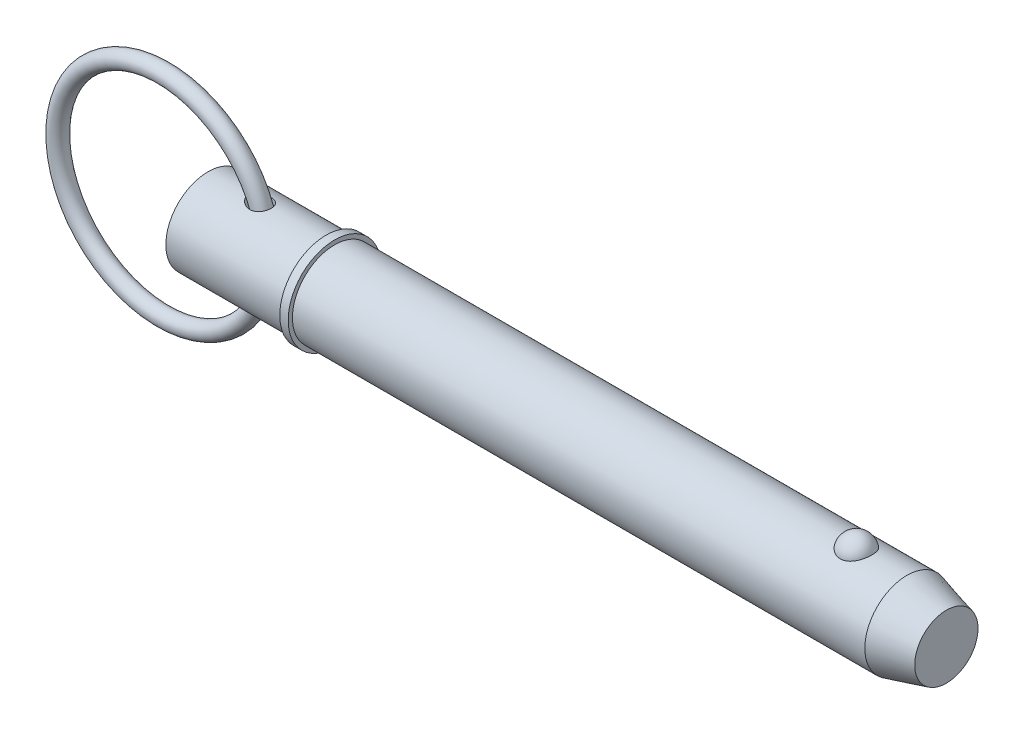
ISO-10303-21;
HEADER;
FILE_DESCRIPTION(('STEP AP214'),'2;1');
FILE_NAME('part.step','',(''),(''),'','','');
FILE_SCHEMA(('AUTOMOTIVE_DESIGN { 1 0 10303 214 1 1 1 1 }'));
ENDSEC;
DATA;
#1=APPLICATION_CONTEXT('core data for automotive mechanical design processes');
#2=APPLICATION_PROTOCOL_DEFINITION('international standard','automotive_design',2000,#1);
#3=PRODUCT_CONTEXT('',#1,'mechanical');
#4=PRODUCT('Part','Part','',(#3));
#5=PRODUCT_RELATED_PRODUCT_CATEGORY('part','',(#4));
#6=PRODUCT_DEFINITION_FORMATION('','',#4);
#7=PRODUCT_DEFINITION_CONTEXT('part definition',#1,'design');
#8=PRODUCT_DEFINITION('design','',#6,#7);
#9=PRODUCT_DEFINITION_SHAPE('','',#8);
#10=(LENGTH_UNIT() NAMED_UNIT(*) SI_UNIT(.MILLI.,.METRE.));
#11=(NAMED_UNIT(*) PLANE_ANGLE_UNIT() SI_UNIT($,.RADIAN.));
#12=(NAMED_UNIT(*) SI_UNIT($,.STERADIAN.) SOLID_ANGLE_UNIT());
#13=UNCERTAINTY_MEASURE_WITH_UNIT(LENGTH_MEASURE(1.E-05),#10,'distance_accuracy_value','');
#14=(GEOMETRIC_REPRESENTATION_CONTEXT(3) GLOBAL_UNCERTAINTY_ASSIGNED_CONTEXT((#13)) GLOBAL_UNIT_ASSIGNED_CONTEXT((#10,
#11,#12)) REPRESENTATION_CONTEXT('',''));
#15=CARTESIAN_POINT('',(0.,0.,0.));
#16=DIRECTION('',(0.,0.,1.));
#17=DIRECTION('',(1.,0.,0.));
#18=AXIS2_PLACEMENT_3D('',#15,#16,#17);
#19=CARTESIAN_POINT('',(-13.4840686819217,0.,0.));
#20=DIRECTION('',(0.,0.,1.));
#21=DIRECTION('',(1.,0.,0.));
#22=AXIS2_PLACEMENT_3D('',#19,#20,#21);
#23=TOROIDAL_SURFACE('',#22,31.75,2.54);
#24=CARTESIAN_POINT('',(20.8059313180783,0.,0.));
#25=VERTEX_POINT('',#24);
#26=VERTEX_LOOP('',#25);
#27=FACE_BOUND('',#26,.T.);
#28=ADVANCED_FACE('P0_F12',(#27),#23,.T.);
#29=CLOSED_SHELL('',(#28));
#30=MANIFOLD_SOLID_BREP('P0_B1',#29);
#31=CARTESIAN_POINT('',(0.,0.,0.));
#32=DIRECTION('',(1.,0.,0.));
#33=DIRECTION('',(0.,0.,-1.));
#34=AXIS2_PLACEMENT_3D('',#31,#32,#33);
#35=CYLINDRICAL_SURFACE('',#34,12.7);
#36=CARTESIAN_POINT('',(13.092900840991,12.5230976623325,-2.11234992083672));
#37=CARTESIAN_POINT('',(13.2535855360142,12.4976398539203,-2.26328363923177));
#38=CARTESIAN_POINT('',(13.4280602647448,12.4718592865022,-2.3995578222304));
#39=CARTESIAN_POINT('',(13.7976341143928,12.4229301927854,-2.64122157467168));
#40=CARTESIAN_POINT('',(13.9927568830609,12.3997847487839,-2.74657519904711));
#41=CARTESIAN_POINT('',(14.397672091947,12.3590534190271,-2.92439761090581));
#42=CARTESIAN_POINT('',(14.6074445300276,12.3414601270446,-2.99691026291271));
#43=CARTESIAN_POINT('',(15.0366557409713,12.3142893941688,-3.10669649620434));
#44=CARTESIAN_POINT('',(15.2560902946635,12.3047084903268,-3.14398530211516));
#45=CARTESIAN_POINT('',(15.5877843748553,12.2976819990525,-3.17128282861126));
#46=CARTESIAN_POINT('',(15.6989364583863,12.2965677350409,-3.17559470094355));
#47=CARTESIAN_POINT('',(15.9211629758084,12.2969101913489,-3.17427486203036));
#48=CARTESIAN_POINT('',(16.0322374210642,12.2983656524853,-3.16864802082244));
#49=CARTESIAN_POINT('',(16.2532861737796,12.3038832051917,-3.14715368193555));
#50=CARTESIAN_POINT('',(16.363260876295,12.3079443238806,-3.13129000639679));
#51=CARTESIAN_POINT('',(16.5810669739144,12.3185954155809,-3.08912320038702));
#52=CARTESIAN_POINT('',(16.6888986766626,12.3251850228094,-3.06282157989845));
#53=CARTESIAN_POINT('',(16.8894247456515,12.3398294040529,-3.00323791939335));
#54=CARTESIAN_POINT('',(16.9824664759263,12.3476389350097,-2.97106098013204));
#55=CARTESIAN_POINT('',(17.1651267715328,12.3648759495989,-2.89848824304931));
#56=CARTESIAN_POINT('',(17.2547457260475,12.3743032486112,-2.85809338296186));
#57=CARTESIAN_POINT('',(17.4297224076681,12.3944822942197,-2.76927391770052));
#58=CARTESIAN_POINT('',(17.5150817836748,12.40523352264,-2.72085245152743));
#59=CARTESIAN_POINT('',(17.6807665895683,12.4277046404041,-2.61629867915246));
#60=CARTESIAN_POINT('',(17.7610923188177,12.4394244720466,-2.56016683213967));
#61=CARTESIAN_POINT('',(17.9797287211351,12.4733252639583,-2.39133767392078));
#62=CARTESIAN_POINT('',(18.1114611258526,12.4961902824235,-2.27005507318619));
#63=CARTESIAN_POINT('',(18.3518677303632,12.5412050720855,-2.00648954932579));
#64=CARTESIAN_POINT('',(18.4605454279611,12.5633549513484,-1.86420981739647));
#65=CARTESIAN_POINT('',(18.6498843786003,12.6039384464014,-1.56614816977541));
#66=CARTESIAN_POINT('',(18.7311185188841,12.622444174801,-1.41073996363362));
#67=CARTESIAN_POINT('',(18.8669149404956,12.6543302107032,-1.08819514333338));
#68=CARTESIAN_POINT('',(18.921477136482,12.6677105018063,-0.921058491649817));
#69=CARTESIAN_POINT('',(19.0028875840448,12.6879542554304,-0.579029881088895));
#70=CARTESIAN_POINT('',(19.0296164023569,12.6947896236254,-0.404107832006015));
#71=CARTESIAN_POINT('',(19.0543673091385,12.7011128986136,-0.0521104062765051));
#72=CARTESIAN_POINT('',(19.0523885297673,12.7006005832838,0.124965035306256));
#73=CARTESIAN_POINT('',(19.019700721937,12.692266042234,0.476969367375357));
#74=CARTESIAN_POINT('',(18.9888798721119,12.6844153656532,0.651887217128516));
#75=CARTESIAN_POINT('',(18.8990221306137,12.6622099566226,0.99389064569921));
#76=CARTESIAN_POINT('',(18.839985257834,12.6478552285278,1.16097622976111));
#77=CARTESIAN_POINT('',(18.6951419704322,12.6142309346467,1.48231767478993));
#78=CARTESIAN_POINT('',(18.6093706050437,12.5949678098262,1.63659000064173));
#79=CARTESIAN_POINT('',(18.4131352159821,12.5536490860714,1.92810749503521));
#80=CARTESIAN_POINT('',(18.3026732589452,12.5315937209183,2.06535408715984));
#81=CARTESIAN_POINT('',(18.060669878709,12.4872833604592,2.31822774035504));
#82=CARTESIAN_POINT('',(17.9292520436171,12.4650302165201,2.43397343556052));
#83=CARTESIAN_POINT('',(17.6485957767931,12.4226514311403,2.64178289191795));
#84=CARTESIAN_POINT('',(17.4993587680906,12.4025256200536,2.73384854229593));
#85=CARTESIAN_POINT('',(17.1869531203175,12.3664726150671,2.8925825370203));
#86=CARTESIAN_POINT('',(17.0237450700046,12.3505578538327,2.95917592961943));
#87=CARTESIAN_POINT('',(16.6884731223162,12.3245177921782,3.06582547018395));
#88=CARTESIAN_POINT('',(16.516407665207,12.3143935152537,3.10587692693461));
#89=CARTESIAN_POINT('',(16.1604213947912,12.3003788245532,3.16093927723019));
#90=CARTESIAN_POINT('',(15.9763106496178,12.2967791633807,3.17478342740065));
#91=CARTESIAN_POINT('',(15.6080973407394,12.2966663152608,3.17521180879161));
#92=CARTESIAN_POINT('',(15.4239948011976,12.3001555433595,3.16178674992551));
#93=CARTESIAN_POINT('',(15.0417156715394,12.3141744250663,3.10676725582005));
#94=CARTESIAN_POINT('',(14.8439465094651,12.3253658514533,3.06251977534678));
#95=CARTESIAN_POINT('',(14.4574652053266,12.3538942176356,2.94531863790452));
#96=CARTESIAN_POINT('',(14.2687614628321,12.3712367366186,2.87233891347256));
#97=CARTESIAN_POINT('',(13.8856104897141,12.4121323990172,2.69045747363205));
#98=CARTESIAN_POINT('',(13.6926012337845,12.4361434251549,2.57861276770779));
#99=CARTESIAN_POINT('',(13.328588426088,12.4862632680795,2.32379935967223));
#100=CARTESIAN_POINT('',(13.1575718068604,12.5123708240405,2.18084927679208));
#101=CARTESIAN_POINT('',(12.8776146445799,12.5579467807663,1.89840233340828));
#102=CARTESIAN_POINT('',(12.7631663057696,12.5776642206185,1.76440341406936));
#103=CARTESIAN_POINT('',(12.5574911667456,12.6143643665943,1.47931295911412));
#104=CARTESIAN_POINT('',(12.4662309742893,12.6313509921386,1.32824646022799));
#105=CARTESIAN_POINT('',(12.3240650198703,12.6583901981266,1.03598403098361));
#106=CARTESIAN_POINT('',(12.2691183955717,12.6691064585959,0.896822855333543));
#107=CARTESIAN_POINT('',(12.1828741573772,12.6860954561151,0.611068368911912));
#108=CARTESIAN_POINT('',(12.1515620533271,12.6923709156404,0.464479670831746));
#109=CARTESIAN_POINT('',(12.1147168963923,12.6997676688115,0.167420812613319));
#110=CARTESIAN_POINT('',(12.1092708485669,12.7008715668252,0.0169392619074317));
#111=CARTESIAN_POINT('',(12.1248234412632,12.6977391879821,-0.282592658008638));
#112=CARTESIAN_POINT('',(12.1458245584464,12.6935024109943,-0.431642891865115));
#113=CARTESIAN_POINT('',(12.210908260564,12.6805581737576,-0.716008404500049));
#114=CARTESIAN_POINT('',(12.2537133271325,12.6720986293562,-0.851633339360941));
#115=CARTESIAN_POINT('',(12.3591295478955,12.6516826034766,-1.11460776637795));
#116=CARTESIAN_POINT('',(12.4217455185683,12.6397252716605,-1.24195523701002));
#117=CARTESIAN_POINT('',(12.5735635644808,12.61152213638,-1.50300095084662));
#118=CARTESIAN_POINT('',(12.6652159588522,12.5949150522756,-1.63522875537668));
#119=CARTESIAN_POINT('',(12.8664347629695,12.5599626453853,-1.88501670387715));
#120=CARTESIAN_POINT('',(12.9760196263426,12.541615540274,-2.0025615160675));
#121=CARTESIAN_POINT('',(13.092900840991,12.5230976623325,-2.11234992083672));
#122=B_SPLINE_CURVE_WITH_KNOTS('',3,(#36,#37,#38,#39,#40,#41,#42,#43,#44,#45,#46,#47,#48,#49,
#50,#51,#52,#53,#54,#55,#56,#57,#58,#59,#60,#61,#62,#63,#64,#65,#66,#67,#68,#69,#70,#71,#72,#73,
#74,#75,#76,#77,#78,#79,#80,#81,#82,#83,#84,#85,#86,#87,#88,#89,#90,#91,#92,#93,#94,#95,#96,#97,
#98,#99,#100,#101,#102,#103,#104,#105,#106,#107,#108,#109,#110,#111,#112,#113,#114,#115,#116,
#117,#118,#119,#120,#121),.UNSPECIFIED.,.T.,.F.,(4,2,2,2,2,2,2,2,2,2,2,2,2,2,2,2,2,2,2,2,2,2,2,
2,2,2,2,2,2,2,2,2,2,2,2,2,2,2,2,2,2,2,4),(0.,0.665132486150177,1.33103515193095,
1.99604575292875,2.66076878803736,2.99410229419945,3.32727250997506,3.66031840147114,
3.99331613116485,4.28918991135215,4.58502994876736,4.88075456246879,5.17646157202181,
5.71510826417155,6.2536731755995,6.78017774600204,7.30668400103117,7.83544030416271,
8.36421259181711,8.89504347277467,9.42587399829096,9.95601150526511,10.4861046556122,
11.0131799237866,11.5402131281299,12.0687854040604,12.5974510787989,13.1491450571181,
13.7010270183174,14.3074556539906,14.914435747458,15.5844380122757,16.2540403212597,
16.7839879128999,17.3131679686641,17.7612578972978,18.2090728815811,18.658393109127,
19.1077554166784,19.5333866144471,19.959121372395,20.4424347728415,20.9262486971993),.UNSPECIFIED.);
#123=CARTESIAN_POINT('',(13.092900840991,12.5230976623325,-2.11234992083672));
#124=VERTEX_POINT('',#123);
#125=EDGE_CURVE('P1_E42',#124,#124,#122,.T.);
#126=ORIENTED_EDGE('',*,*,#125,.T.);
#127=EDGE_LOOP('',(#126));
#128=FACE_BOUND('',#127,.T.);
#129=CARTESIAN_POINT('',(0.,0.,0.));
#130=DIRECTION('',(1.,0.,0.));
#131=DIRECTION('',(0.,0.,-1.));
#132=AXIS2_PLACEMENT_3D('',#129,#130,#131);
#133=CIRCLE('',#132,12.7);
#134=CARTESIAN_POINT('',(0.,0.,-12.7));
#135=VERTEX_POINT('',#134);
#136=EDGE_CURVE('P1_E9',#135,#135,#133,.T.);
#137=ORIENTED_EDGE('',*,*,#136,.T.);
#138=EDGE_LOOP('',(#137));
#139=FACE_BOUND('',#138,.T.);
#140=CARTESIAN_POINT('',(35.56,0.,0.));
#141=DIRECTION('',(1.,0.,0.));
#142=DIRECTION('',(0.,0.,-1.));
#143=AXIS2_PLACEMENT_3D('',#140,#141,#142);
#144=CIRCLE('',#143,12.7);
#145=CARTESIAN_POINT('',(35.56,0.,-12.7));
#146=VERTEX_POINT('',#145);
#147=EDGE_CURVE('P1_E25',#146,#146,#144,.T.);
#148=ORIENTED_EDGE('',*,*,#147,.F.);
#149=EDGE_LOOP('',(#148));
#150=FACE_BOUND('',#149,.T.);
#151=CARTESIAN_POINT('',(13.092900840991,-12.5230976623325,-2.11234992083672));
#152=CARTESIAN_POINT('',(12.9659872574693,-12.5432050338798,-1.99314161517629));
#153=CARTESIAN_POINT('',(12.847667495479,-12.5631124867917,-1.86478966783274));
#154=CARTESIAN_POINT('',(12.6324721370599,-12.6007427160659,-1.59069749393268));
#155=CARTESIAN_POINT('',(12.5355833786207,-12.6184668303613,-1.444968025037));
#156=CARTESIAN_POINT('',(12.409907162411,-12.642034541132,-1.21450950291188));
#157=CARTESIAN_POINT('',(12.3711427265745,-12.6494175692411,-1.13527163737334));
#158=CARTESIAN_POINT('',(12.3010994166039,-12.6628962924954,-0.973464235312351));
#159=CARTESIAN_POINT('',(12.2698164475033,-12.6689926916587,-0.890896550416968));
#160=CARTESIAN_POINT('',(12.2153933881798,-12.6796767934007,-0.723090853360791));
#161=CARTESIAN_POINT('',(12.192246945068,-12.6842656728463,-0.637854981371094));
#162=CARTESIAN_POINT('',(12.154603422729,-12.6917620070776,-0.465421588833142));
#163=CARTESIAN_POINT('',(12.1401047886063,-12.69466976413,-0.378224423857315));
#164=CARTESIAN_POINT('',(12.1214471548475,-12.6984180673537,-0.214417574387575));
#165=CARTESIAN_POINT('',(12.1161713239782,-12.699481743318,-0.137938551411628));
#166=CARTESIAN_POINT('',(12.1124989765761,-12.7002217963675,0.0152189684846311));
#167=CARTESIAN_POINT('',(12.1141046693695,-12.6998977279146,0.0918975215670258));
#168=CARTESIAN_POINT('',(12.1241695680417,-12.6978712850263,0.24474645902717));
#169=CARTESIAN_POINT('',(12.132625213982,-12.6961696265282,0.320917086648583));
#170=CARTESIAN_POINT('',(12.1562110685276,-12.6914452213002,0.472185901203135));
#171=CARTESIAN_POINT('',(12.1713438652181,-12.6884219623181,0.547283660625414));
#172=CARTESIAN_POINT('',(12.223731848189,-12.6780227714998,0.759415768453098));
#173=CARTESIAN_POINT('',(12.268839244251,-12.6691353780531,0.894507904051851));
#174=CARTESIAN_POINT('',(12.3786059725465,-12.6479567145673,1.1560647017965));
#175=CARTESIAN_POINT('',(12.4432700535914,-12.6356646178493,1.28252725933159));
#176=CARTESIAN_POINT('',(12.5971341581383,-12.607236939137,1.5381272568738));
#177=CARTESIAN_POINT('',(12.6882234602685,-12.5908303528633,1.66609325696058));
#178=CARTESIAN_POINT('',(12.887209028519,-12.5564642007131,1.90792082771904));
#179=CARTESIAN_POINT('',(12.995115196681,-12.5385037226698,2.02177401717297));
#180=CARTESIAN_POINT('',(13.2471335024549,-12.4987806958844,2.25547266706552));
#181=CARTESIAN_POINT('',(13.3941979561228,-12.4769622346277,2.3721269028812));
#182=CARTESIAN_POINT('',(13.7036983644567,-12.4349587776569,2.58329351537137));
#183=CARTESIAN_POINT('',(13.8661464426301,-12.4147750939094,2.67778822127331));
#184=CARTESIAN_POINT('',(14.2306024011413,-12.3748157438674,2.85722657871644));
#185=CARTESIAN_POINT('',(14.4347220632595,-12.3556533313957,2.93804226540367));
#186=CARTESIAN_POINT('',(14.8540416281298,-12.3245430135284,3.06594877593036));
#187=CARTESIAN_POINT('',(15.0692453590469,-12.3125976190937,3.11302786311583));
#188=CARTESIAN_POINT('',(15.3981213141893,-12.3014943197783,3.15648626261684));
#189=CARTESIAN_POINT('',(15.5100235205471,-12.298940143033,3.16639841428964));
#190=CARTESIAN_POINT('',(15.7342812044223,-12.2963942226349,3.17627668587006));
#191=CARTESIAN_POINT('',(15.8466364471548,-12.2964012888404,3.1762474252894));
#192=CARTESIAN_POINT('',(16.0707903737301,-12.2990694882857,3.16589868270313));
#193=CARTESIAN_POINT('',(16.1825892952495,-12.3017293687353,3.1555840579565));
#194=CARTESIAN_POINT('',(16.4046123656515,-12.3096862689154,3.12440163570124));
#195=CARTESIAN_POINT('',(16.514836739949,-12.314982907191,3.10353536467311));
#196=CARTESIAN_POINT('',(16.7211934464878,-12.3273933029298,3.05384263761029));
#197=CARTESIAN_POINT('',(16.8175961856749,-12.3342598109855,3.0260738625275));
#198=CARTESIAN_POINT('',(17.0073515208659,-12.3498131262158,2.96195947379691));
#199=CARTESIAN_POINT('',(17.100704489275,-12.3584997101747,2.92561491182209));
#200=CARTESIAN_POINT('',(17.2834584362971,-12.3774243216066,2.84448580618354));
#201=CARTESIAN_POINT('',(17.3728610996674,-12.3876616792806,2.79970490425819));
#202=CARTESIAN_POINT('',(17.5469061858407,-12.409352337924,2.701939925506));
#203=CARTESIAN_POINT('',(17.6315489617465,-12.4208055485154,2.64895645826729));
#204=CARTESIAN_POINT('',(17.7872886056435,-12.4433734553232,2.54070972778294));
#205=CARTESIAN_POINT('',(17.8589017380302,-12.4544123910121,2.48617167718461));
#206=CARTESIAN_POINT('',(17.9970802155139,-12.4768404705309,2.37105291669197));
#207=CARTESIAN_POINT('',(18.063643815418,-12.4882297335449,2.31047013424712));
#208=CARTESIAN_POINT('',(18.1911677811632,-12.5110137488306,2.18372894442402));
#209=CARTESIAN_POINT('',(18.2521311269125,-12.5224084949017,2.11757353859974));
#210=CARTESIAN_POINT('',(18.3680676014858,-12.5448751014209,1.98014449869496));
#211=CARTESIAN_POINT('',(18.4230385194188,-12.5559468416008,1.90886899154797));
#212=CARTESIAN_POINT('',(18.5752306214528,-12.5875288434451,1.69257698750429));
#213=CARTESIAN_POINT('',(18.6637018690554,-12.6071482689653,1.54111740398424));
#214=CARTESIAN_POINT('',(18.8143485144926,-12.6417556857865,1.225260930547));
#215=CARTESIAN_POINT('',(18.876524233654,-12.6567437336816,1.06086419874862));
#216=CARTESIAN_POINT('',(18.9733884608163,-12.6805238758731,0.723195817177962));
#217=CARTESIAN_POINT('',(19.0079967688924,-12.6892978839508,0.549899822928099));
#218=CARTESIAN_POINT('',(19.0486500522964,-12.6996362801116,0.199781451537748));
#219=CARTESIAN_POINT('',(19.054694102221,-12.7012004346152,0.0229589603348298));
#220=CARTESIAN_POINT('',(19.0380549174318,-12.6969431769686,-0.330044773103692));
#221=CARTESIAN_POINT('',(19.0152419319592,-12.6910884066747,-0.506219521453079));
#222=CARTESIAN_POINT('',(18.9411599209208,-12.672565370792,-0.852112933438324));
#223=CARTESIAN_POINT('',(18.8898907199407,-12.659897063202,-1.0218315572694));
#224=CARTESIAN_POINT('',(18.7600888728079,-12.6291327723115,-1.34987035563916));
#225=CARTESIAN_POINT('',(18.6815715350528,-12.6110398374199,-1.50819687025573));
#226=CARTESIAN_POINT('',(18.4991526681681,-12.5714188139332,-1.808997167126));
#227=CARTESIAN_POINT('',(18.3952529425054,-12.5498909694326,-1.95147207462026));
#228=CARTESIAN_POINT('',(18.1653806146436,-12.5059234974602,-2.21580059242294));
#229=CARTESIAN_POINT('',(18.0395297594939,-12.4834893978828,-2.33776101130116));
#230=CARTESIAN_POINT('',(17.7688701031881,-12.4400863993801,-2.55870399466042));
#231=CARTESIAN_POINT('',(17.6240631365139,-12.4191173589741,-2.65768878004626));
#232=CARTESIAN_POINT('',(17.3196803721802,-12.380896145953,-2.8304192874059));
#233=CARTESIAN_POINT('',(17.1601036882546,-12.3636441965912,-2.90416349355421));
#234=CARTESIAN_POINT('',(16.8308162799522,-12.3345597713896,-3.02531546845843));
#235=CARTESIAN_POINT('',(16.6611041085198,-12.322728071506,-3.07271946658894));
#236=CARTESIAN_POINT('',(16.3099674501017,-12.3051318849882,-3.14246490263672));
#237=CARTESIAN_POINT('',(16.1283412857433,-12.2996014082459,-3.16384159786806));
#238=CARTESIAN_POINT('',(15.7639014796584,-12.2955807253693,-3.17942379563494));
#239=CARTESIAN_POINT('',(15.5810875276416,-12.2970924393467,-3.17362188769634));
#240=CARTESIAN_POINT('',(15.20154276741,-12.307074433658,-3.13470416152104));
#241=CARTESIAN_POINT('',(15.0050835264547,-12.316173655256,-3.09911848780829));
#242=CARTESIAN_POINT('',(14.6197996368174,-12.3407987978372,-2.99954607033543));
#243=CARTESIAN_POINT('',(14.4309834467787,-12.3563316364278,-2.93552875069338));
#244=CARTESIAN_POINT('',(14.0353751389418,-12.3949378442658,-2.76840280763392));
#245=CARTESIAN_POINT('',(13.8306109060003,-12.4188242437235,-2.66064798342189));
#246=CARTESIAN_POINT('',(13.4432099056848,-12.4696241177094,-2.4113475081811));
#247=CARTESIAN_POINT('',(13.2605568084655,-12.4965353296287,-2.26982702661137));
#248=CARTESIAN_POINT('',(13.092900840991,-12.5230976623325,-2.11234992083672));
#249=B_SPLINE_CURVE_WITH_KNOTS('',3,(#151,#152,#153,#154,#155,#156,#157,#158,#159,#160,#161,
#162,#163,#164,#165,#166,#167,#168,#169,#170,#171,#172,#173,#174,#175,#176,#177,#178,#179,#180,
#181,#182,#183,#184,#185,#186,#187,#188,#189,#190,#191,#192,#193,#194,#195,#196,#197,#198,#199,
#200,#201,#202,#203,#204,#205,#206,#207,#208,#209,#210,#211,#212,#213,#214,#215,#216,#217,#218,
#219,#220,#221,#222,#223,#224,#225,#226,#227,#228,#229,#230,#231,#232,#233,#234,#235,#236,#237,
#238,#239,#240,#241,#242,#243,#244,#245,#246,#247,#248),.UNSPECIFIED.,.T.,.F.,(4,2,2,2,2,2,2,2,
2,2,2,2,2,2,2,2,2,2,2,2,2,2,2,2,2,2,2,2,2,2,2,2,2,2,2,2,2,2,2,2,2,2,2,2,2,2,2,2,4),(0.,
0.525289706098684,1.05025590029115,1.31549608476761,1.58059075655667,1.84547798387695,
2.11031756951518,2.34000998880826,2.56977615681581,2.79942299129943,3.0291589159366,
3.45531787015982,3.8815803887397,4.35362362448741,4.82594586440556,5.39074449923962,
5.95599200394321,6.61421946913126,7.27267581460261,7.60939383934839,7.9459554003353,
8.2823580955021,8.61871213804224,8.91997243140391,9.22119579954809,9.52228943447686,
9.82336070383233,10.0950952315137,10.3669232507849,10.6386057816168,10.9103882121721,
11.4371688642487,11.9639430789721,12.4922442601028,13.0205625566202,13.5512648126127,
14.0819703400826,14.6123781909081,15.1427483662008,15.6702654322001,16.1977314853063,
16.7252292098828,17.2528024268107,17.7993878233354,18.3461222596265,18.9432829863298,
19.541087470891,20.2355241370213,20.9294447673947),.UNSPECIFIED.);
#250=CARTESIAN_POINT('',(13.092900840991,-12.5230976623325,-2.11234992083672));
#251=VERTEX_POINT('',#250);
#252=EDGE_CURVE('P1_E17',#251,#251,#249,.T.);
#253=ORIENTED_EDGE('',*,*,#252,.T.);
#254=EDGE_LOOP('',(#253));
#255=FACE_BOUND('',#254,.T.);
#256=ADVANCED_FACE('P1_F13',(#128,#139,#150,#255),#35,.T.);
#257=CARTESIAN_POINT('',(0.,0.,0.));
#258=DIRECTION('',(1.,0.,0.));
#259=DIRECTION('',(0.,0.,-1.));
#260=AXIS2_PLACEMENT_3D('',#257,#258,#259);
#261=CYLINDRICAL_SURFACE('',#260,12.7);
#262=CARTESIAN_POINT('',(210.400738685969,0.,0.));
#263=DIRECTION('',(1.,0.,0.));
#264=DIRECTION('',(0.,0.,-1.));
#265=AXIS2_PLACEMENT_3D('',#262,#263,#264);
#266=CIRCLE('',#265,12.7);
#267=CARTESIAN_POINT('',(210.400738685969,0.,-12.7));
#268=VERTEX_POINT('',#267);
#269=EDGE_CURVE('P1_E99',#268,#268,#266,.T.);
#270=ORIENTED_EDGE('',*,*,#269,.F.);
#271=EDGE_LOOP('',(#270));
#272=FACE_BOUND('',#271,.T.);
#273=CARTESIAN_POINT('',(38.1,0.,0.));
#274=DIRECTION('',(1.,0.,0.));
#275=DIRECTION('',(0.,0.,-1.));
#276=AXIS2_PLACEMENT_3D('',#273,#274,#275);
#277=CIRCLE('',#276,12.7);
#278=CARTESIAN_POINT('',(38.1,0.,-12.7));
#279=VERTEX_POINT('',#278);
#280=EDGE_CURVE('P1_E96',#279,#279,#277,.T.);
#281=ORIENTED_EDGE('',*,*,#280,.T.);
#282=EDGE_LOOP('',(#281));
#283=FACE_BOUND('',#282,.T.);
#284=CARTESIAN_POINT('',(195.160042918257,11.7500437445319,4.81938502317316));
#285=CARTESIAN_POINT('',(195.035088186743,11.7500430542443,4.81938571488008));
#286=CARTESIAN_POINT('',(194.910144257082,11.7520975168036,4.81438658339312));
#287=CARTESIAN_POINT('',(194.661142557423,11.760253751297,4.79442904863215));
#288=CARTESIAN_POINT('',(194.537085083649,11.7663568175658,4.77946746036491));
#289=CARTESIAN_POINT('',(194.290901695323,11.7824262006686,4.73971414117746));
#290=CARTESIAN_POINT('',(194.168774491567,11.7923898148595,4.71492928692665));
#291=CARTESIAN_POINT('',(193.927187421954,11.8158938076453,4.65571340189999));
#292=CARTESIAN_POINT('',(193.80772859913,11.8294355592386,4.62127866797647));
#293=CARTESIAN_POINT('',(193.572557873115,11.8596812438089,4.54309502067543));
#294=CARTESIAN_POINT('',(193.456839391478,11.8763792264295,4.49936361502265));
#295=CARTESIAN_POINT('',(193.229653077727,11.9124878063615,4.40287235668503));
#296=CARTESIAN_POINT('',(193.118186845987,11.9318994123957,4.35010914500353));
#297=CARTESIAN_POINT('',(192.791278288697,11.9934256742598,4.17881316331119));
#298=CARTESIAN_POINT('',(192.583127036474,12.038858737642,4.04720756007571));
#299=CARTESIAN_POINT('',(192.185850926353,12.1352173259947,3.74856446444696));
#300=CARTESIAN_POINT('',(191.997443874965,12.1862630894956,3.5806182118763));
#301=CARTESIAN_POINT('',(191.650521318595,12.2875163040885,3.2160075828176));
#302=CARTESIAN_POINT('',(191.492011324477,12.3377235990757,3.01933792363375));
#303=CARTESIAN_POINT('',(191.20168878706,12.4344923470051,2.59291655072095));
#304=CARTESIAN_POINT('',(191.071376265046,12.4807925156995,2.36208286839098));
#305=CARTESIAN_POINT('',(190.849407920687,12.5623454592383,1.88070399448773));
#306=CARTESIAN_POINT('',(190.757755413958,12.5975972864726,1.63015711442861));
#307=CARTESIAN_POINT('',(190.614046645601,12.6538414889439,1.11298869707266));
#308=CARTESIAN_POINT('',(190.562499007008,12.6746503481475,0.846205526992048));
#309=CARTESIAN_POINT('',(190.501977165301,12.699153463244,0.307085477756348));
#310=CARTESIAN_POINT('',(190.493001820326,12.7028481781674,0.0347487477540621));
#311=CARTESIAN_POINT('',(190.517731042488,12.6927785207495,-0.506073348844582));
#312=CARTESIAN_POINT('',(190.551189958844,12.6791146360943,-0.774571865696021));
#313=CARTESIAN_POINT('',(190.659687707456,12.635882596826,-1.30170246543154));
#314=CARTESIAN_POINT('',(190.73472729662,12.606314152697,-1.56033436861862));
#315=CARTESIAN_POINT('',(190.925000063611,12.5342328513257,-2.06083899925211));
#316=CARTESIAN_POINT('',(191.040287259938,12.4917026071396,-2.30268867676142));
#317=CARTESIAN_POINT('',(191.308704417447,12.3981123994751,-2.76259600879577));
#318=CARTESIAN_POINT('',(191.461837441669,12.3470517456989,-2.98065173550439));
#319=CARTESIAN_POINT('',(191.803507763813,12.2416045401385,-3.38786328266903));
#320=CARTESIAN_POINT('',(191.992201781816,12.1872040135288,-3.57688418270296));
#321=CARTESIAN_POINT('',(192.400239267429,12.0814086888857,-3.91941073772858));
#322=CARTESIAN_POINT('',(192.619580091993,12.0300136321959,-4.07291945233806));
#323=CARTESIAN_POINT('',(193.078375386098,11.9373542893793,-4.33691289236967));
#324=CARTESIAN_POINT('',(193.317304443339,11.8958982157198,-4.44824125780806));
#325=CARTESIAN_POINT('',(193.81243761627,11.8268116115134,-4.62881985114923));
#326=CARTESIAN_POINT('',(194.068635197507,11.7991758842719,-4.69808589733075));
#327=CARTESIAN_POINT('',(194.577164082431,11.7622209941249,-4.78983181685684));
#328=CARTESIAN_POINT('',(194.829041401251,11.7520502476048,-4.8144902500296));
#329=CARTESIAN_POINT('',(195.333573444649,11.7485796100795,-4.82295735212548));
#330=CARTESIAN_POINT('',(195.586228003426,11.7552763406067,-4.80677420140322));
#331=CARTESIAN_POINT('',(196.076834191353,11.7842584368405,-4.73525430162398));
#332=CARTESIAN_POINT('',(196.314998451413,11.8060486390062,-4.68116061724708));
#333=CARTESIAN_POINT('',(196.778489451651,11.8622750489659,-4.53678133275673));
#334=CARTESIAN_POINT('',(197.003815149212,11.8967122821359,-4.44649279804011));
#335=CARTESIAN_POINT('',(197.440801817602,11.9754603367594,-4.22987613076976));
#336=CARTESIAN_POINT('',(197.652057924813,12.0199699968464,-4.10280539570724));
#337=CARTESIAN_POINT('',(198.050601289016,12.1138028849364,-3.81685409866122));
#338=CARTESIAN_POINT('',(198.237883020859,12.163127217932,-3.65796622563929));
#339=CARTESIAN_POINT('',(198.593350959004,12.2642343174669,-3.30364864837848));
#340=CARTESIAN_POINT('',(198.760111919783,12.3160165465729,-3.10678783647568));
#341=CARTESIAN_POINT('',(199.059579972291,12.4142566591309,-2.68748409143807));
#342=CARTESIAN_POINT('',(199.192280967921,12.4607135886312,-2.46503658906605));
#343=CARTESIAN_POINT('',(199.424691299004,12.5450236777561,-1.99289519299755));
#344=CARTESIAN_POINT('',(199.523215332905,12.5825557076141,-1.74255918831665));
#345=CARTESIAN_POINT('',(199.679227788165,12.6431720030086,-1.22773734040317));
#346=CARTESIAN_POINT('',(199.736715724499,12.6662560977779,-0.963251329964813));
#347=CARTESIAN_POINT('',(199.809544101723,12.6956486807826,-0.427355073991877));
#348=CARTESIAN_POINT('',(199.824837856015,12.7019385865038,-0.155937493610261));
#349=CARTESIAN_POINT('',(199.812779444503,12.6970201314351,0.385928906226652));
#350=CARTESIAN_POINT('',(199.78542805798,12.6858120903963,0.656377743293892));
#351=CARTESIAN_POINT('',(199.713060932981,12.6568455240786,1.05454017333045));
#352=CARTESIAN_POINT('',(199.683796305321,12.6451962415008,1.18577850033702));
#353=CARTESIAN_POINT('',(199.615022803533,12.6181819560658,1.44513808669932));
#354=CARTESIAN_POINT('',(199.575517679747,12.6028183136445,1.57326046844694));
#355=CARTESIAN_POINT('',(199.486439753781,12.5687547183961,1.82554978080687));
#356=CARTESIAN_POINT('',(199.436862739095,12.5500533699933,1.94971503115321));
#357=CARTESIAN_POINT('',(199.32792115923,12.5098093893,2.19314370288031));
#358=CARTESIAN_POINT('',(199.268560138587,12.4882677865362,2.31240887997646));
#359=CARTESIAN_POINT('',(199.13997128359,12.4427679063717,2.5459303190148));
#360=CARTESIAN_POINT('',(199.070688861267,12.4187964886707,2.66015396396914));
#361=CARTESIAN_POINT('',(198.922903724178,12.3691892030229,2.882026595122));
#362=CARTESIAN_POINT('',(198.844404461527,12.3435539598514,2.98967802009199));
#363=CARTESIAN_POINT('',(198.678550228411,12.2912955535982,3.1977438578));
#364=CARTESIAN_POINT('',(198.591191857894,12.2646720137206,3.29815546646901));
#365=CARTESIAN_POINT('',(198.408161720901,12.2111945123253,3.49095035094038));
#366=CARTESIAN_POINT('',(198.312493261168,12.1843406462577,3.58333679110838));
#367=CARTESIAN_POINT('',(198.113627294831,12.1312249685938,3.75922876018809));
#368=CARTESIAN_POINT('',(198.010450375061,12.104961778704,3.84275713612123));
#369=CARTESIAN_POINT('',(197.79701336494,12.0537284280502,4.00056406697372));
#370=CARTESIAN_POINT('',(197.686756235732,12.028757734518,4.07484645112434));
#371=CARTESIAN_POINT('',(197.459755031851,11.9808306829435,4.21367959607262));
#372=CARTESIAN_POINT('',(197.343006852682,11.9578756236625,4.27822410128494));
#373=CARTESIAN_POINT('',(197.10394258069,11.9147184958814,4.39698483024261));
#374=CARTESIAN_POINT('',(196.981628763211,11.894515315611,4.45120522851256));
#375=CARTESIAN_POINT('',(196.722952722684,11.8561129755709,4.55255353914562));
#376=CARTESIAN_POINT('',(196.586223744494,11.8381764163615,4.59884858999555));
#377=CARTESIAN_POINT('',(196.308608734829,11.8069093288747,4.67853897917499));
#378=CARTESIAN_POINT('',(196.167724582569,11.7935767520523,4.71194005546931));
#379=CARTESIAN_POINT('',(195.88309446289,11.7720277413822,4.7655218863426));
#380=CARTESIAN_POINT('',(195.739348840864,11.7638106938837,4.7857042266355));
#381=CARTESIAN_POINT('',(195.450411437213,11.7528195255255,4.81263433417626));
#382=CARTESIAN_POINT('',(195.305219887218,11.7500445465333,4.81938421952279));
#383=CARTESIAN_POINT('',(195.160042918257,11.7500437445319,4.81938502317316));
#384=B_SPLINE_CURVE_WITH_KNOTS('',3,(#284,#285,#286,#287,#288,#289,#290,#291,#292,#293,#294,
#295,#296,#297,#298,#299,#300,#301,#302,#303,#304,#305,#306,#307,#308,#309,#310,#311,#312,#313,
#314,#315,#316,#317,#318,#319,#320,#321,#322,#323,#324,#325,#326,#327,#328,#329,#330,#331,#332,
#333,#334,#335,#336,#337,#338,#339,#340,#341,#342,#343,#344,#345,#346,#347,#348,#349,#350,#351,
#352,#353,#354,#355,#356,#357,#358,#359,#360,#361,#362,#363,#364,#365,#366,#367,#368,#369,#370,
#371,#372,#373,#374,#375,#376,#377,#378,#379,#380,#381,#382,#383),.UNSPECIFIED.,.T.,.F.,(4,2,2,
2,2,2,2,2,2,2,2,2,2,2,2,2,2,2,2,2,2,2,2,2,2,2,2,2,2,2,2,2,2,2,2,2,2,2,2,2,2,2,2,2,2,2,2,2,2,4),
(0.,0.374729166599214,0.749578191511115,1.12416526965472,1.49889629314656,1.87292776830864,
2.24709865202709,2.99481328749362,3.76399449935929,4.53331735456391,5.33683915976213,
6.14042986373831,6.95405296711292,7.76765424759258,8.57656703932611,9.38549455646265,
10.1955119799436,11.0055949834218,11.8193353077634,12.6330054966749,13.4294141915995,
14.2255231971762,14.9815786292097,15.7374826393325,16.4696948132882,17.2019663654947,
17.950197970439,18.6986017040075,19.484470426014,20.2704797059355,21.0815215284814,
21.8925729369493,22.7045213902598,23.5164550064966,23.9209608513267,24.3253187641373,
24.7298461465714,25.1342272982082,25.5409255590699,25.9474719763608,26.3541750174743,
26.760716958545,27.1661834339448,27.5714814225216,27.9770386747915,28.382431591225,
28.8181206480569,29.2536155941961,29.6890582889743,30.1244323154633),.UNSPECIFIED.);
#385=CARTESIAN_POINT('',(195.160042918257,11.7500437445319,4.81938502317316));
#386=VERTEX_POINT('',#385);
#387=EDGE_CURVE('P1_E34',#386,#386,#384,.T.);
#388=ORIENTED_EDGE('',*,*,#387,.T.);
#389=EDGE_LOOP('',(#388));
#390=FACE_BOUND('',#389,.T.);
#391=ADVANCED_FACE('P1_F46',(#272,#283,#390),#261,.T.);
#392=CARTESIAN_POINT('',(0.,0.,0.));
#393=DIRECTION('',(-1.,0.,0.));
#394=DIRECTION('',(0.,0.,1.));
#395=AXIS2_PLACEMENT_3D('',#392,#393,#394);
#396=PLANE('',#395);
#397=ORIENTED_EDGE('',*,*,#136,.F.);
#398=EDGE_LOOP('',(#397));
#399=FACE_BOUND('',#398,.T.);
#400=ADVANCED_FACE('P1_F15',(#399),#396,.T.);
#401=CARTESIAN_POINT('',(35.56,12.7,0.));
#402=DIRECTION('',(-1.,0.,0.));
#403=DIRECTION('',(0.,0.,1.));
#404=AXIS2_PLACEMENT_3D('',#401,#402,#403);
#405=PLANE('',#404);
#406=ORIENTED_EDGE('',*,*,#147,.T.);
#407=EDGE_LOOP('',(#406));
#408=FACE_BOUND('',#407,.T.);
#409=CARTESIAN_POINT('',(35.56,0.,0.));
#410=DIRECTION('',(1.,0.,0.));
#411=DIRECTION('',(0.,0.,-1.));
#412=AXIS2_PLACEMENT_3D('',#409,#410,#411);
#413=CIRCLE('',#412,13.97);
#414=CARTESIAN_POINT('',(35.56,0.,-13.97));
#415=VERTEX_POINT('',#414);
#416=EDGE_CURVE('P1_E30',#415,#415,#413,.T.);
#417=ORIENTED_EDGE('',*,*,#416,.F.);
#418=EDGE_LOOP('',(#417));
#419=FACE_BOUND('',#418,.T.);
#420=ADVANCED_FACE('P1_F81',(#408,#419),#405,.T.);
#421=CARTESIAN_POINT('',(0.,0.,0.));
#422=DIRECTION('',(1.,0.,0.));
#423=DIRECTION('',(0.,0.,-1.));
#424=AXIS2_PLACEMENT_3D('',#421,#422,#423);
#425=CYLINDRICAL_SURFACE('',#424,13.97);
#426=ORIENTED_EDGE('',*,*,#416,.T.);
#427=EDGE_LOOP('',(#426));
#428=FACE_BOUND('',#427,.T.);
#429=CARTESIAN_POINT('',(38.1,0.,0.));
#430=DIRECTION('',(1.,0.,0.));
#431=DIRECTION('',(0.,0.,-1.));
#432=AXIS2_PLACEMENT_3D('',#429,#430,#431);
#433=CIRCLE('',#432,13.97);
#434=CARTESIAN_POINT('',(38.1,0.,-13.97));
#435=VERTEX_POINT('',#434);
#436=EDGE_CURVE('P1_E95',#435,#435,#433,.T.);
#437=ORIENTED_EDGE('',*,*,#436,.F.);
#438=EDGE_LOOP('',(#437));
#439=FACE_BOUND('',#438,.T.);
#440=ADVANCED_FACE('P1_F68',(#428,#439),#425,.T.);
#441=CARTESIAN_POINT('',(38.1,13.97,0.));
#442=DIRECTION('',(1.,0.,0.));
#443=DIRECTION('',(0.,0.,-1.));
#444=AXIS2_PLACEMENT_3D('',#441,#442,#443);
#445=PLANE('',#444);
#446=ORIENTED_EDGE('',*,*,#436,.T.);
#447=EDGE_LOOP('',(#446));
#448=FACE_BOUND('',#447,.T.);
#449=ORIENTED_EDGE('',*,*,#280,.F.);
#450=EDGE_LOOP('',(#449));
#451=FACE_BOUND('',#450,.T.);
#452=ADVANCED_FACE('P1_F62',(#448,#451),#445,.T.);
#453=CARTESIAN_POINT('',(222.25,0.,0.));
#454=DIRECTION('',(-1.,0.,0.));
#455=DIRECTION('',(0.,0.,1.));
#456=AXIS2_PLACEMENT_3D('',#453,#454,#455);
#457=CONICAL_SURFACE('',#456,9.52500000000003,0.26179938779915);
#458=ORIENTED_EDGE('',*,*,#269,.T.);
#459=EDGE_LOOP('',(#458));
#460=FACE_BOUND('',#459,.T.);
#461=CARTESIAN_POINT('',(222.25,0.,0.));
#462=DIRECTION('',(1.,0.,0.));
#463=DIRECTION('',(0.,0.,-1.));
#464=AXIS2_PLACEMENT_3D('',#461,#462,#463);
#465=CIRCLE('',#464,9.52500000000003);
#466=CARTESIAN_POINT('',(222.25,0.,-9.52500000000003));
#467=VERTEX_POINT('',#466);
#468=EDGE_CURVE('P1_E41',#467,#467,#465,.T.);
#469=ORIENTED_EDGE('',*,*,#468,.F.);
#470=EDGE_LOOP('',(#469));
#471=FACE_BOUND('',#470,.T.);
#472=ADVANCED_FACE('P1_F59',(#460,#471),#457,.T.);
#473=CARTESIAN_POINT('',(222.25,9.52500000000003,0.));
#474=DIRECTION('',(1.,0.,0.));
#475=DIRECTION('',(0.,0.,-1.));
#476=AXIS2_PLACEMENT_3D('',#473,#474,#475);
#477=PLANE('',#476);
#478=ORIENTED_EDGE('',*,*,#468,.T.);
#479=EDGE_LOOP('',(#478));
#480=FACE_BOUND('',#479,.T.);
#481=ADVANCED_FACE('P1_F55',(#480),#477,.T.);
#482=CARTESIAN_POINT('',(195.160042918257,11.43,0.));
#483=DIRECTION('',(-1.,0.,0.));
#484=DIRECTION('',(0.,1.,0.));
#485=AXIS2_PLACEMENT_3D('',#482,#483,#484);
#486=SPHERICAL_SURFACE('',#485,4.82999999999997);
#487=ORIENTED_EDGE('',*,*,#387,.F.);
#488=EDGE_LOOP('',(#487));
#489=FACE_BOUND('',#488,.T.);
#490=ADVANCED_FACE('P1_F50',(#489),#486,.T.);
#491=CARTESIAN_POINT('',(-13.4840686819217,0.,0.));
#492=DIRECTION('',(0.,0.,1.));
#493=DIRECTION('',(1.,0.,0.));
#494=AXIS2_PLACEMENT_3D('',#491,#492,#493);
#495=TOROIDAL_SURFACE('',#494,31.75,3.175);
#496=ORIENTED_EDGE('',*,*,#252,.F.);
#497=EDGE_LOOP('',(#496));
#498=FACE_BOUND('',#497,.T.);
#499=ORIENTED_EDGE('',*,*,#125,.F.);
#500=EDGE_LOOP('',(#499));
#501=FACE_BOUND('',#500,.T.);
#502=ADVANCED_FACE('P1_F54',(#498,#501),#495,.F.);
#503=CLOSED_SHELL('',(#256,#391,#400,#420,#440,#452,#472,#481,#490,#502));
#504=MANIFOLD_SOLID_BREP('P1_B1',#503);
#505=ADVANCED_BREP_SHAPE_REPRESENTATION('',(#18,#30,#504),#14);
#506=SHAPE_DEFINITION_REPRESENTATION(#9,#505);
ENDSEC;
END-ISO-10303-21;
